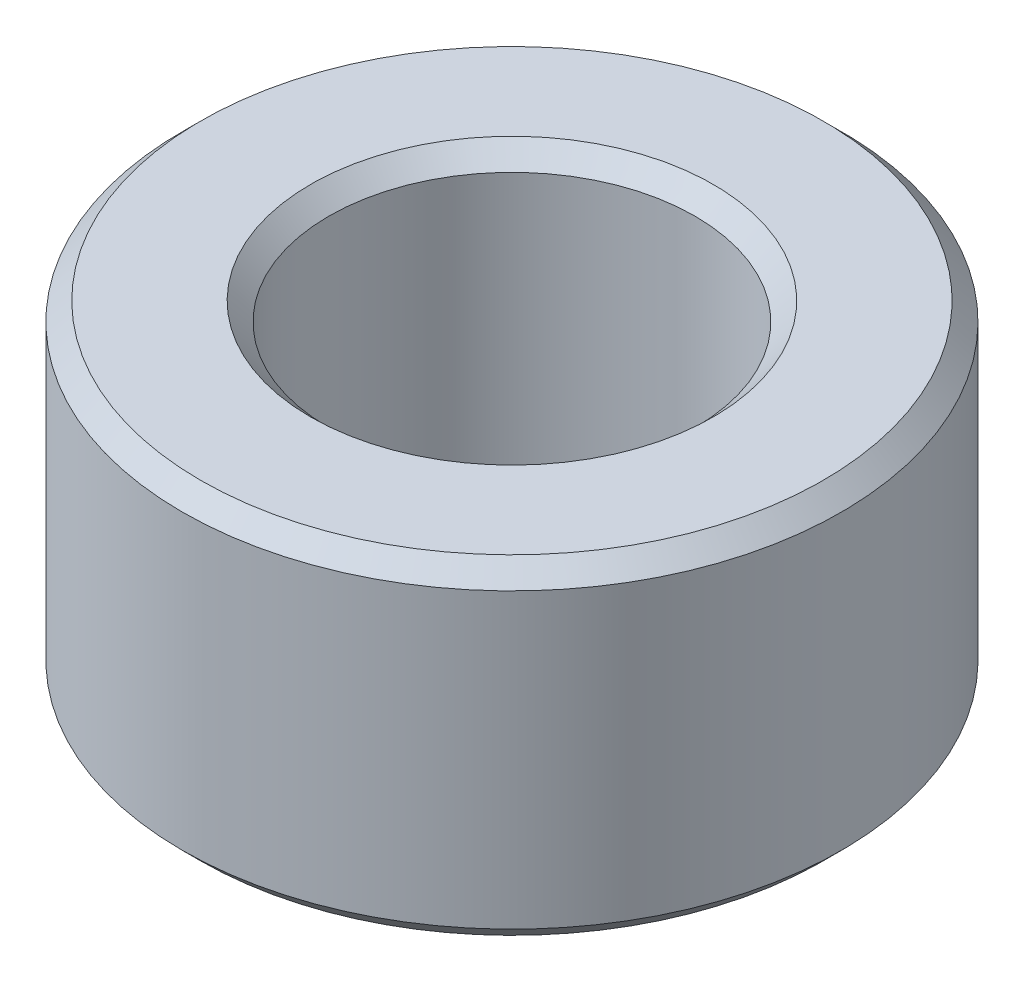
ISO-10303-21;
HEADER;
FILE_DESCRIPTION(('STEP AP214'),'2;1');
FILE_NAME('part.step','',(''),(''),'','','');
FILE_SCHEMA(('AUTOMOTIVE_DESIGN { 1 0 10303 214 1 1 1 1 }'));
ENDSEC;
DATA;
#1=APPLICATION_CONTEXT('core data for automotive mechanical design processes');
#2=APPLICATION_PROTOCOL_DEFINITION('international standard','automotive_design',2000,#1);
#3=PRODUCT_CONTEXT('',#1,'mechanical');
#4=PRODUCT('Part','Part','',(#3));
#5=PRODUCT_RELATED_PRODUCT_CATEGORY('part','',(#4));
#6=PRODUCT_DEFINITION_FORMATION('','',#4);
#7=PRODUCT_DEFINITION_CONTEXT('part definition',#1,'design');
#8=PRODUCT_DEFINITION('design','',#6,#7);
#9=PRODUCT_DEFINITION_SHAPE('','',#8);
#10=(LENGTH_UNIT() NAMED_UNIT(*) SI_UNIT(.MILLI.,.METRE.));
#11=(NAMED_UNIT(*) PLANE_ANGLE_UNIT() SI_UNIT($,.RADIAN.));
#12=(NAMED_UNIT(*) SI_UNIT($,.STERADIAN.) SOLID_ANGLE_UNIT());
#13=UNCERTAINTY_MEASURE_WITH_UNIT(LENGTH_MEASURE(1.E-05),#10,'distance_accuracy_value','');
#14=(GEOMETRIC_REPRESENTATION_CONTEXT(3) GLOBAL_UNCERTAINTY_ASSIGNED_CONTEXT((#13)) GLOBAL_UNIT_ASSIGNED_CONTEXT((#10,
#11,#12)) REPRESENTATION_CONTEXT('',''));
#15=CARTESIAN_POINT('',(0.,0.,0.));
#16=DIRECTION('',(0.,0.,1.));
#17=DIRECTION('',(1.,0.,0.));
#18=AXIS2_PLACEMENT_3D('',#15,#16,#17);
#19=CARTESIAN_POINT('',(0.,0.5,0.));
#20=DIRECTION('',(0.,1.,0.));
#21=DIRECTION('',(0.,0.,1.));
#22=AXIS2_PLACEMENT_3D('',#19,#20,#21);
#23=CONICAL_SURFACE('',#22,8.99999999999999,0.785398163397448);
#24=CARTESIAN_POINT('',(0.,0.,0.));
#25=DIRECTION('',(0.,1.,0.));
#26=DIRECTION('',(0.,0.,1.));
#27=AXIS2_PLACEMENT_3D('',#24,#25,#26);
#28=CIRCLE('',#27,8.49999999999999);
#29=CARTESIAN_POINT('',(0.,0.,8.49999999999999));
#30=VERTEX_POINT('',#29);
#31=EDGE_CURVE('E55',#30,#30,#28,.T.);
#32=ORIENTED_EDGE('',*,*,#31,.T.);
#33=EDGE_LOOP('',(#32));
#34=FACE_BOUND('',#33,.T.);
#35=CARTESIAN_POINT('',(0.,0.5,0.));
#36=DIRECTION('',(0.,1.,0.));
#37=DIRECTION('',(0.,0.,1.));
#38=AXIS2_PLACEMENT_3D('',#35,#36,#37);
#39=CIRCLE('',#38,8.99999999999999);
#40=CARTESIAN_POINT('',(0.,0.5,8.99999999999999));
#41=VERTEX_POINT('',#40);
#42=EDGE_CURVE('E10',#41,#41,#39,.T.);
#43=ORIENTED_EDGE('',*,*,#42,.F.);
#44=EDGE_LOOP('',(#43));
#45=FACE_BOUND('',#44,.T.);
#46=ADVANCED_FACE('F27',(#34,#45),#23,.T.);
#47=CARTESIAN_POINT('',(0.,40.,0.));
#48=DIRECTION('',(0.,1.,0.));
#49=DIRECTION('',(0.,0.,1.));
#50=AXIS2_PLACEMENT_3D('',#47,#48,#49);
#51=CYLINDRICAL_SURFACE('',#50,8.99999999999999);
#52=ORIENTED_EDGE('',*,*,#42,.T.);
#53=EDGE_LOOP('',(#52));
#54=FACE_BOUND('',#53,.T.);
#55=CARTESIAN_POINT('',(0.,8.5,0.));
#56=DIRECTION('',(0.,1.,0.));
#57=DIRECTION('',(0.,0.,1.));
#58=AXIS2_PLACEMENT_3D('',#55,#56,#57);
#59=CIRCLE('',#58,9.);
#60=CARTESIAN_POINT('',(0.,8.5,9.));
#61=VERTEX_POINT('',#60);
#62=EDGE_CURVE('E33',#61,#61,#59,.T.);
#63=ORIENTED_EDGE('',*,*,#62,.F.);
#64=EDGE_LOOP('',(#63));
#65=FACE_BOUND('',#64,.T.);
#66=ADVANCED_FACE('F73',(#54,#65),#51,.T.);
#67=CARTESIAN_POINT('',(0.,9.,0.));
#68=DIRECTION('',(0.,-1.,0.));
#69=DIRECTION('',(0.,0.,-1.));
#70=AXIS2_PLACEMENT_3D('',#67,#68,#69);
#71=CONICAL_SURFACE('',#70,8.49999999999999,0.78539816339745);
#72=ORIENTED_EDGE('',*,*,#62,.T.);
#73=EDGE_LOOP('',(#72));
#74=FACE_BOUND('',#73,.T.);
#75=CARTESIAN_POINT('',(0.,9.,0.));
#76=DIRECTION('',(0.,1.,0.));
#77=DIRECTION('',(0.,0.,1.));
#78=AXIS2_PLACEMENT_3D('',#75,#76,#77);
#79=CIRCLE('',#78,8.49999999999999);
#80=CARTESIAN_POINT('',(0.,9.,8.49999999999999));
#81=VERTEX_POINT('',#80);
#82=EDGE_CURVE('E37',#81,#81,#79,.T.);
#83=ORIENTED_EDGE('',*,*,#82,.F.);
#84=EDGE_LOOP('',(#83));
#85=FACE_BOUND('',#84,.T.);
#86=ADVANCED_FACE('F77',(#74,#85),#71,.T.);
#87=CARTESIAN_POINT('',(-8.49999999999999,9.,0.));
#88=DIRECTION('',(0.,1.,0.));
#89=DIRECTION('',(0.,0.,1.));
#90=AXIS2_PLACEMENT_3D('',#87,#88,#89);
#91=PLANE('',#90);
#92=ORIENTED_EDGE('',*,*,#82,.T.);
#93=EDGE_LOOP('',(#92));
#94=FACE_BOUND('',#93,.T.);
#95=CARTESIAN_POINT('',(0.,9.,0.));
#96=DIRECTION('',(0.,1.,0.));
#97=DIRECTION('',(0.,0.,1.));
#98=AXIS2_PLACEMENT_3D('',#95,#96,#97);
#99=CIRCLE('',#98,5.5);
#100=CARTESIAN_POINT('',(0.,9.,5.5));
#101=VERTEX_POINT('',#100);
#102=EDGE_CURVE('E41',#101,#101,#99,.T.);
#103=ORIENTED_EDGE('',*,*,#102,.F.);
#104=EDGE_LOOP('',(#103));
#105=FACE_BOUND('',#104,.T.);
#106=ADVANCED_FACE('F81',(#94,#105),#91,.T.);
#107=CARTESIAN_POINT('',(0.,8.5,0.));
#108=DIRECTION('',(0.,1.,0.));
#109=DIRECTION('',(0.,0.,1.));
#110=AXIS2_PLACEMENT_3D('',#107,#108,#109);
#111=CONICAL_SURFACE('',#110,5.,0.785398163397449);
#112=ORIENTED_EDGE('',*,*,#102,.T.);
#113=EDGE_LOOP('',(#112));
#114=FACE_BOUND('',#113,.T.);
#115=CARTESIAN_POINT('',(0.,8.5,0.));
#116=DIRECTION('',(0.,1.,0.));
#117=DIRECTION('',(0.,0.,1.));
#118=AXIS2_PLACEMENT_3D('',#115,#116,#117);
#119=CIRCLE('',#118,5.);
#120=CARTESIAN_POINT('',(0.,8.5,5.));
#121=VERTEX_POINT('',#120);
#122=EDGE_CURVE('E46',#121,#121,#119,.T.);
#123=ORIENTED_EDGE('',*,*,#122,.F.);
#124=EDGE_LOOP('',(#123));
#125=FACE_BOUND('',#124,.T.);
#126=ADVANCED_FACE('F87',(#114,#125),#111,.F.);
#127=CARTESIAN_POINT('',(0.,40.,0.));
#128=DIRECTION('',(0.,1.,0.));
#129=DIRECTION('',(0.,0.,1.));
#130=AXIS2_PLACEMENT_3D('',#127,#128,#129);
#131=CYLINDRICAL_SURFACE('',#130,5.);
#132=ORIENTED_EDGE('',*,*,#122,.T.);
#133=EDGE_LOOP('',(#132));
#134=FACE_BOUND('',#133,.T.);
#135=CARTESIAN_POINT('',(0.,0.500000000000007,0.));
#136=DIRECTION('',(0.,1.,0.));
#137=DIRECTION('',(0.,0.,1.));
#138=AXIS2_PLACEMENT_3D('',#135,#136,#137);
#139=CIRCLE('',#138,4.99999999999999);
#140=CARTESIAN_POINT('',(0.,0.500000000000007,4.99999999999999));
#141=VERTEX_POINT('',#140);
#142=EDGE_CURVE('E49',#141,#141,#139,.T.);
#143=ORIENTED_EDGE('',*,*,#142,.F.);
#144=EDGE_LOOP('',(#143));
#145=FACE_BOUND('',#144,.T.);
#146=ADVANCED_FACE('F69',(#134,#145),#131,.F.);
#147=CARTESIAN_POINT('',(0.,0.,0.));
#148=DIRECTION('',(0.,-1.,0.));
#149=DIRECTION('',(0.,0.,-1.));
#150=AXIS2_PLACEMENT_3D('',#147,#148,#149);
#151=CONICAL_SURFACE('',#150,5.49999999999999,0.785398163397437);
#152=ORIENTED_EDGE('',*,*,#142,.T.);
#153=EDGE_LOOP('',(#152));
#154=FACE_BOUND('',#153,.T.);
#155=CARTESIAN_POINT('',(0.,0.,0.));
#156=DIRECTION('',(0.,1.,0.));
#157=DIRECTION('',(0.,0.,1.));
#158=AXIS2_PLACEMENT_3D('',#155,#156,#157);
#159=CIRCLE('',#158,5.49999999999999);
#160=CARTESIAN_POINT('',(0.,0.,5.49999999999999));
#161=VERTEX_POINT('',#160);
#162=EDGE_CURVE('E52',#161,#161,#159,.T.);
#163=ORIENTED_EDGE('',*,*,#162,.F.);
#164=EDGE_LOOP('',(#163));
#165=FACE_BOUND('',#164,.T.);
#166=ADVANCED_FACE('F63',(#154,#165),#151,.F.);
#167=CARTESIAN_POINT('',(-5.49999999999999,0.,0.));
#168=DIRECTION('',(0.,-1.,0.));
#169=DIRECTION('',(0.,0.,-1.));
#170=AXIS2_PLACEMENT_3D('',#167,#168,#169);
#171=PLANE('',#170);
#172=ORIENTED_EDGE('',*,*,#162,.T.);
#173=EDGE_LOOP('',(#172));
#174=FACE_BOUND('',#173,.T.);
#175=ORIENTED_EDGE('',*,*,#31,.F.);
#176=EDGE_LOOP('',(#175));
#177=FACE_BOUND('',#176,.T.);
#178=ADVANCED_FACE('F61',(#174,#177),#171,.T.);
#179=CLOSED_SHELL('',(#46,#66,#86,#106,#126,#146,#166,#178));
#180=MANIFOLD_SOLID_BREP('B2',#179);
#181=ADVANCED_BREP_SHAPE_REPRESENTATION('',(#18,#180),#14);
#182=SHAPE_DEFINITION_REPRESENTATION(#9,#181);
ENDSEC;
END-ISO-10303-21;
